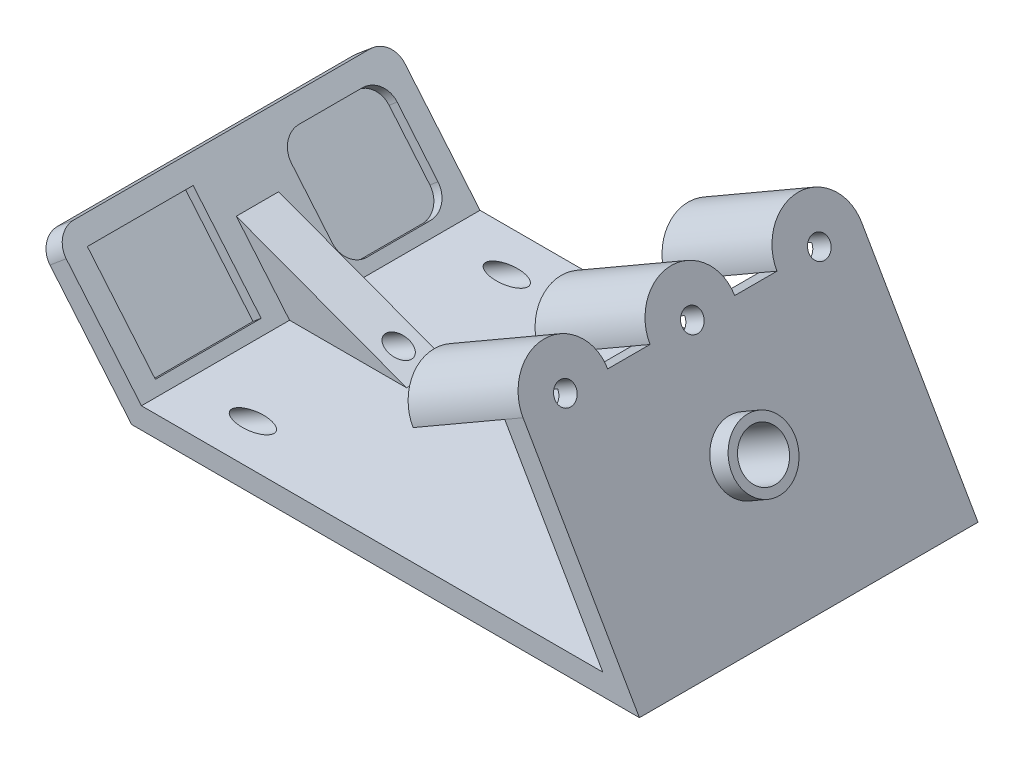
from build123d import *

# Parameters (mm, degrees)
EXTRUDE_THIN1_DEPTH             = 80
RIB1_REACH                      = 137.162
SKETCH4_WALL_W                  = 315.282714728
SKETCH4_WALL_H                  = 10
BOSS_EXTRUDE1_DEPTH             = 30
SKETCH6_R                       = 2.5
SKETCH6_R_2                     = 5.5
CUT_EXTRUDE1_DEPTH              = 148.498143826
SKETCH7_R                       = 7.5
SKETCH7_R_2                     = 5.5
BOSS_EXTRUDE2_DEPTH             = 5
BOSS_EXTRUDE2_DIRECTION_2_REACH = 149.498
SKETCH8_W                       = 25
SKETCH8_H                       = 25
CUT_EXTRUDE2_DEPTH              = 2.5
FILLET1_R                       = 5


with BuildPart() as part:
    # Sketch3 → Extrude-Thin1 (new body)
    with BuildSketch(Plane.XY):
        Polygon((-22.497566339, 26.811555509), (0, 0), (120, 0), (92.5, 47.631397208), (88.169872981, 45.131397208), (111.339745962, 5), (2.331538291, 5), (-18.667344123, 30.025493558), align=None)
    extrude(amount=-EXTRUDE_THIN1_DEPTH)

    # Sketch4 wall → Rib1 (add, up to next)
    with BuildSketch(Plane(origin=(9.872521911, 12.5, -40), x_dir=(0.937058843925, -0.349171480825, 0), z_dir=(0.349171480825, 0.937058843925, 0)), mode=Mode.PRIVATE) as rib1_sk1:
        Rectangle(SKETCH4_WALL_W, SKETCH4_WALL_H)
    rib1_tool1 = extrude(rib1_sk1.sketch, amount=-RIB1_REACH, mode=Mode.PRIVATE) - part.part
    add(rib1_tool1.solids().sort_by_distance((9.872521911, 12.5, -40))[0])

    # Sketch5 → Boss-Extrude1 (add)
    with BuildSketch(Plane(origin=(90, 51.961524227, 0), x_dir=(0, 0, -1), z_dir=(0.8660254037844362, 0.5000000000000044, 0))):
        with BuildLine():
            Line((0, -5), (20, -5))
            ThreePointArc((20, -5), (10, 5), (0, -5))
        make_face()
        with BuildLine():
            Line((30, -5), (50, -5))
            ThreePointArc((50, -5), (40, 5), (30, -5))
        make_face()
        with BuildLine():
            Line((60, -5), (80, -5))
            ThreePointArc((80, -5), (70, 5), (60, -5))
        make_face()
    extrude(amount=-BOSS_EXTRUDE1_DEPTH)

    # Sketch6 → Cut-Extrude1 (cut, through all)
    with BuildSketch(Plane(origin=(90, 51.961524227, 0), x_dir=(0, 0, -1), z_dir=(0.8660254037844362, 0.5000000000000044, 0))):
        with Locations(Location((10, -5, 0), (0, 0, 90))):
            Circle(SKETCH6_R)
        with Locations(Location((40, -5, 0), (0, 0, 90))):
            Circle(SKETCH6_R)
        with Locations(Location((70, -5, 0), (0, 0, 90))):
            Circle(SKETCH6_R)
        with Locations(Location((40, -30, 0), (0, 0, 90))):
            Circle(SKETCH6_R_2)
    extrude(amount=-CUT_EXTRUDE1_DEPTH, mode=Mode.SUBTRACT)

    # Sketch7 → Boss-Extrude2 (add)
    with BuildSketch(Plane(origin=(90, 51.961524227, 0), x_dir=(0, 0, -1), z_dir=(0.8660254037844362, 0.5000000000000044, 0))):
        with Locations(Location((40, -30, 0), (0, 0, 90))):
            Circle(SKETCH7_R)
        with Locations(Location((40, -30, 0), (0, 0, 90))):
            Circle(SKETCH7_R_2, mode=Mode.SUBTRACT)
    extrude(amount=BOSS_EXTRUDE2_DEPTH)

    # Boss-Extrude2 direction 2: up to this plane
    boss_extrude2_direction_2_end = Plane(origin=(0, 5, -80), z_dir=(0, -1, 0))
    # Sketch7 → Boss-Extrude2 direction 2 (add, up to the surface)
    with BuildSketch(Plane(origin=(90, 51.961524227, 0), x_dir=(0, 0, -1), z_dir=(0.8660254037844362, 0.5000000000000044, 0)), mode=Mode.PRIVATE) as boss_extrude2_direction_2_sk1:
        with Locations(Location((40, -30, 0), (0, 0, 90))):
            Circle(SKETCH7_R)
        with Locations(Location((40, -30, 0), (0, 0, 90))):
            Circle(SKETCH7_R_2, mode=Mode.SUBTRACT)
    boss_extrude2_direction_2_tool1 = split(extrude(boss_extrude2_direction_2_sk1.sketch, amount=-BOSS_EXTRUDE2_DIRECTION_2_REACH, mode=Mode.PRIVATE), bisect_by=boss_extrude2_direction_2_end, keep=Keep.BOTH, mode=Mode.PRIVATE)
    add(boss_extrude2_direction_2_tool1.solids().sort_by_distance((108.643934, 19.669283, -40))[0])

    # Sketch8 → Cut-Extrude2 (cut)
    with BuildSketch(Plane(origin=(3.830222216, 3.213938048, 0), x_dir=(0.6427876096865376, -0.7660444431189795, 0), z_dir=(0.7660444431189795, 0.6427876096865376, 0))):
        with Locations((-17.5, 17.5)):
            Rectangle(SKETCH8_W, SKETCH8_H)
        with Locations((-17.5, 62.5)):
            Rectangle(SKETCH8_W, SKETCH8_H)
    extrude(amount=-CUT_EXTRUDE2_DEPTH, mode=Mode.SUBTRACT)

    # Fillet1
    fillet1_edges = [part.edges().sort_by_distance(p)[0] for p in [
        (-0.341271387, 6.240675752, -75),
        (-0.341271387, 6.240675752, -50),
        (-16.410961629, 25.39178683, -50),
        (-16.410961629, 25.39178683, -75),
        (-20.582455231, 28.418524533, -80),
        (-20.582455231, 28.418524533, 0),
    ]]
    fillet(fillet1_edges, radius=FILLET1_R)


solid = part.part
